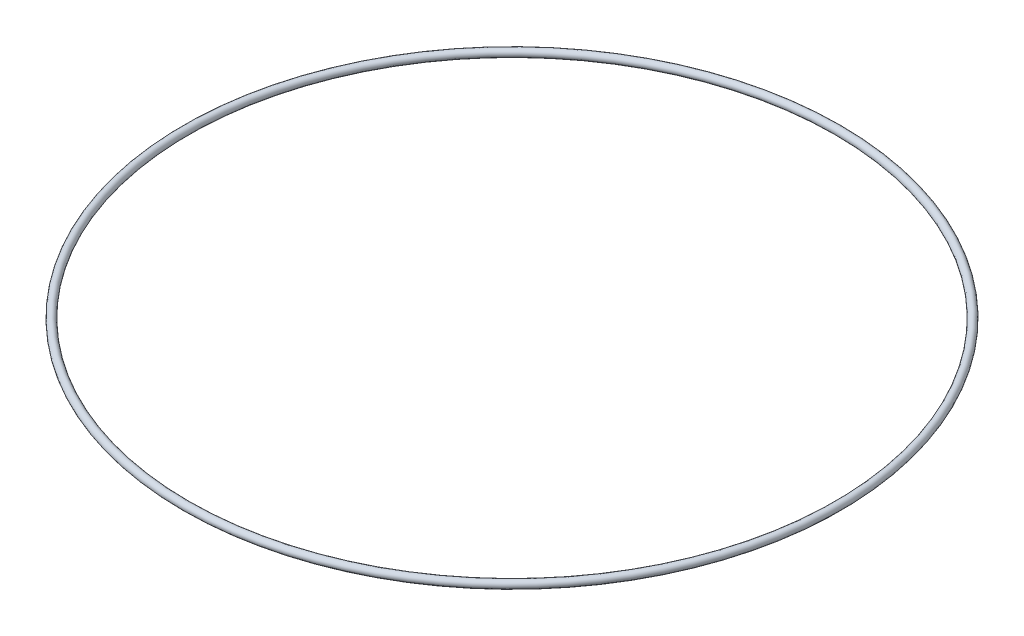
from build123d import *

# Parameters (mm, degrees)
ESQUISSE1_R = 1.5


with BuildPart() as part:
    # Esquisse1 → Base-R_volution (revolve)
    with BuildSketch(Plane.XY, mode=Mode.PRIVATE) as base_r_volution_sk:
        with Locations((127.25, 0)):
            Circle(ESQUISSE1_R)
    revolve(base_r_volution_sk.sketch.rotate(Axis((0, 1.5, 0), (0, -1, 0)), 90), axis=Axis((0, 1.5, 0), (0, -1, 0)))


solid = part.part
